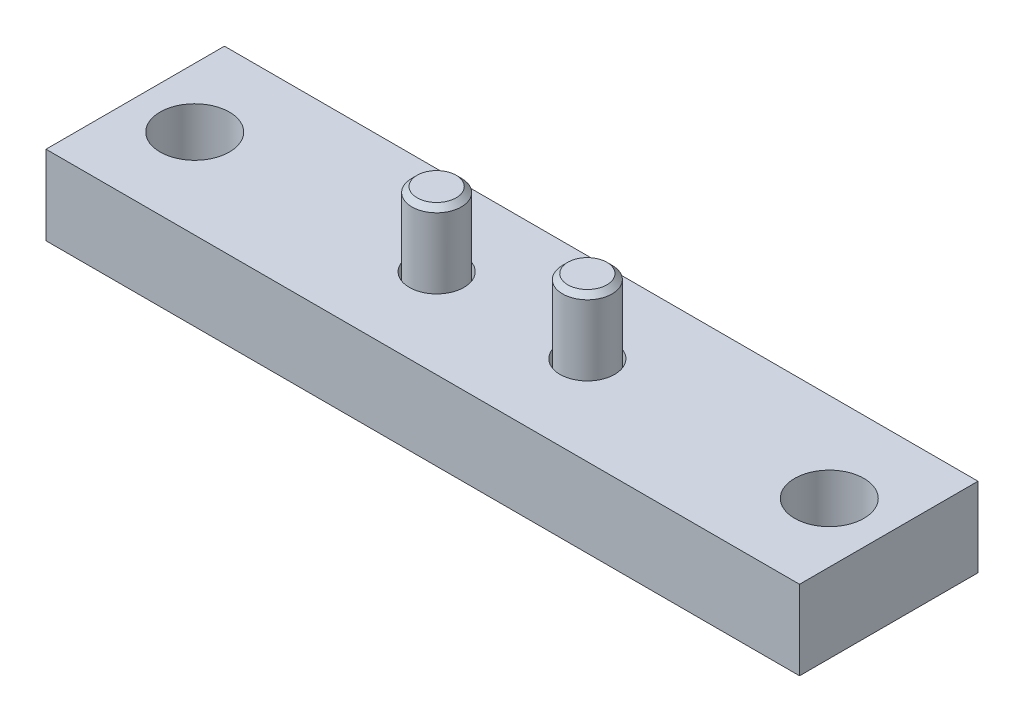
ISO-10303-21;
HEADER;
FILE_DESCRIPTION(('STEP AP214'),'2;1');
FILE_NAME('part.step','',(''),(''),'','','');
FILE_SCHEMA(('AUTOMOTIVE_DESIGN { 1 0 10303 214 1 1 1 1 }'));
ENDSEC;
DATA;
#1=APPLICATION_CONTEXT('core data for automotive mechanical design processes');
#2=APPLICATION_PROTOCOL_DEFINITION('international standard','automotive_design',2000,#1);
#3=PRODUCT_CONTEXT('',#1,'mechanical');
#4=PRODUCT('Part','Part','',(#3));
#5=PRODUCT_RELATED_PRODUCT_CATEGORY('part','',(#4));
#6=PRODUCT_DEFINITION_FORMATION('','',#4);
#7=PRODUCT_DEFINITION_CONTEXT('part definition',#1,'design');
#8=PRODUCT_DEFINITION('design','',#6,#7);
#9=PRODUCT_DEFINITION_SHAPE('','',#8);
#10=(LENGTH_UNIT() NAMED_UNIT(*) SI_UNIT(.MILLI.,.METRE.));
#11=(NAMED_UNIT(*) PLANE_ANGLE_UNIT() SI_UNIT($,.RADIAN.));
#12=(NAMED_UNIT(*) SI_UNIT($,.STERADIAN.) SOLID_ANGLE_UNIT());
#13=UNCERTAINTY_MEASURE_WITH_UNIT(LENGTH_MEASURE(1.E-05),#10,'distance_accuracy_value','');
#14=(GEOMETRIC_REPRESENTATION_CONTEXT(3) GLOBAL_UNCERTAINTY_ASSIGNED_CONTEXT((#13)) GLOBAL_UNIT_ASSIGNED_CONTEXT((#10,
#11,#12)) REPRESENTATION_CONTEXT('',''));
#15=CARTESIAN_POINT('',(0.,0.,0.));
#16=DIRECTION('',(0.,0.,1.));
#17=DIRECTION('',(1.,0.,0.));
#18=AXIS2_PLACEMENT_3D('',#15,#16,#17);
#19=CARTESIAN_POINT('',(60.325,-12.7,-14.2875));
#20=DIRECTION('',(0.,-1.,0.));
#21=DIRECTION('',(0.,0.,1.));
#22=AXIS2_PLACEMENT_3D('',#19,#20,#21);
#23=PLANE('',#22);
#24=CARTESIAN_POINT('',(50.8,-12.7,0.));
#25=DIRECTION('',(0.,-1.,0.));
#26=DIRECTION('',(0.,0.,1.));
#27=AXIS2_PLACEMENT_3D('',#24,#25,#26);
#28=CIRCLE('',#27,5.5499);
#29=CARTESIAN_POINT('',(50.8,-12.7,5.5499));
#30=VERTEX_POINT('',#29);
#31=EDGE_CURVE('E257',#30,#30,#28,.T.);
#32=ORIENTED_EDGE('',*,*,#31,.F.);
#33=EDGE_LOOP('',(#32));
#34=FACE_BOUND('',#33,.T.);
#35=CARTESIAN_POINT('',(-50.8,-12.7,0.));
#36=DIRECTION('',(0.,-1.,0.));
#37=DIRECTION('',(0.,0.,1.));
#38=AXIS2_PLACEMENT_3D('',#35,#36,#37);
#39=CIRCLE('',#38,5.5499);
#40=CARTESIAN_POINT('',(-50.8,-12.7,5.5499));
#41=VERTEX_POINT('',#40);
#42=EDGE_CURVE('E390',#41,#41,#39,.T.);
#43=ORIENTED_EDGE('',*,*,#42,.F.);
#44=EDGE_LOOP('',(#43));
#45=FACE_BOUND('',#44,.T.);
#46=CARTESIAN_POINT('',(12.065,-12.7,0.));
#47=DIRECTION('',(0.,-1.,0.));
#48=DIRECTION('',(0.,0.,1.));
#49=AXIS2_PLACEMENT_3D('',#46,#47,#48);
#50=CIRCLE('',#49,7.112);
#51=CARTESIAN_POINT('',(12.065,-12.7,7.112));
#52=VERTEX_POINT('',#51);
#53=EDGE_CURVE('E378',#52,#52,#50,.T.);
#54=ORIENTED_EDGE('',*,*,#53,.F.);
#55=EDGE_LOOP('',(#54));
#56=FACE_BOUND('',#55,.T.);
#57=CARTESIAN_POINT('',(-12.065,-12.7,0.));
#58=DIRECTION('',(0.,-1.,0.));
#59=DIRECTION('',(0.,0.,1.));
#60=AXIS2_PLACEMENT_3D('',#57,#58,#59);
#61=CIRCLE('',#60,7.112);
#62=CARTESIAN_POINT('',(-12.065,-12.7,7.112));
#63=VERTEX_POINT('',#62);
#64=EDGE_CURVE('E362',#63,#63,#61,.T.);
#65=ORIENTED_EDGE('',*,*,#64,.F.);
#66=EDGE_LOOP('',(#65));
#67=FACE_BOUND('',#66,.T.);
#68=DIRECTION('',(0.,0.,1.));
#69=VECTOR('',#68,1.);
#70=CARTESIAN_POINT('',(60.325,-12.7,-14.2875));
#71=LINE('',#70,#69);
#72=CARTESIAN_POINT('',(60.325,-12.7,-14.2875));
#73=VERTEX_POINT('',#72);
#74=CARTESIAN_POINT('',(60.325,-12.7,14.2875));
#75=VERTEX_POINT('',#74);
#76=EDGE_CURVE('E354',#73,#75,#71,.T.);
#77=ORIENTED_EDGE('',*,*,#76,.T.);
#78=DIRECTION('',(-1.,0.,0.));
#79=VECTOR('',#78,1.);
#80=CARTESIAN_POINT('',(60.325,-12.7,14.2875));
#81=LINE('',#80,#79);
#82=CARTESIAN_POINT('',(-60.325,-12.7,14.2875));
#83=VERTEX_POINT('',#82);
#84=EDGE_CURVE('E366',#75,#83,#81,.T.);
#85=ORIENTED_EDGE('',*,*,#84,.T.);
#86=DIRECTION('',(0.,0.,-1.));
#87=VECTOR('',#86,1.);
#88=CARTESIAN_POINT('',(-60.325,-12.7,-14.2875));
#89=LINE('',#88,#87);
#90=CARTESIAN_POINT('',(-60.325,-12.7,-14.2875));
#91=VERTEX_POINT('',#90);
#92=EDGE_CURVE('E364',#83,#91,#89,.T.);
#93=ORIENTED_EDGE('',*,*,#92,.T.);
#94=DIRECTION('',(1.,0.,0.));
#95=VECTOR('',#94,1.);
#96=CARTESIAN_POINT('',(60.325,-12.7,-14.2875));
#97=LINE('',#96,#95);
#98=EDGE_CURVE('E35',#91,#73,#97,.T.);
#99=ORIENTED_EDGE('',*,*,#98,.T.);
#100=EDGE_LOOP('',(#77,#85,#93,#99));
#101=FACE_BOUND('',#100,.T.);
#102=ADVANCED_FACE('F16',(#34,#45,#56,#67,#101),#23,.T.);
#103=CARTESIAN_POINT('',(12.065,-12.7,0.));
#104=DIRECTION('',(0.,-1.,0.));
#105=DIRECTION('',(0.,0.,1.));
#106=AXIS2_PLACEMENT_3D('',#103,#104,#105);
#107=CYLINDRICAL_SURFACE('',#106,7.112);
#108=CARTESIAN_POINT('',(12.065,-4.064,0.));
#109=DIRECTION('',(0.,-1.,0.));
#110=DIRECTION('',(0.,0.,1.));
#111=AXIS2_PLACEMENT_3D('',#108,#109,#110);
#112=CIRCLE('',#111,7.112);
#113=CARTESIAN_POINT('',(12.065,-4.064,7.112));
#114=VERTEX_POINT('',#113);
#115=EDGE_CURVE('E381',#114,#114,#112,.T.);
#116=ORIENTED_EDGE('',*,*,#115,.F.);
#117=EDGE_LOOP('',(#116));
#118=FACE_BOUND('',#117,.T.);
#119=ORIENTED_EDGE('',*,*,#53,.T.);
#120=EDGE_LOOP('',(#119));
#121=FACE_BOUND('',#120,.T.);
#122=ADVANCED_FACE('F403',(#118,#121),#107,.F.);
#123=CARTESIAN_POINT('',(7.6962,-4.064,0.));
#124=DIRECTION('',(0.,1.,0.));
#125=DIRECTION('',(0.,0.,-1.));
#126=AXIS2_PLACEMENT_3D('',#123,#124,#125);
#127=PLANE('',#126);
#128=CARTESIAN_POINT('',(12.065,-4.064,0.));
#129=DIRECTION('',(0.,1.,0.));
#130=DIRECTION('',(0.,0.,1.));
#131=AXIS2_PLACEMENT_3D('',#128,#129,#130);
#132=CIRCLE('',#131,5.95376);
#133=CARTESIAN_POINT('',(12.065,-4.064,5.95376));
#134=VERTEX_POINT('',#133);
#135=EDGE_CURVE('E334',#134,#134,#132,.T.);
#136=ORIENTED_EDGE('',*,*,#135,.T.);
#137=EDGE_LOOP('',(#136));
#138=FACE_BOUND('',#137,.T.);
#139=ORIENTED_EDGE('',*,*,#115,.T.);
#140=EDGE_LOOP('',(#139));
#141=FACE_BOUND('',#140,.T.);
#142=ADVANCED_FACE('F524',(#138,#141),#127,.F.);
#143=CARTESIAN_POINT('',(-12.065,-12.7,0.));
#144=DIRECTION('',(0.,-1.,0.));
#145=DIRECTION('',(0.,0.,1.));
#146=AXIS2_PLACEMENT_3D('',#143,#144,#145);
#147=CYLINDRICAL_SURFACE('',#146,7.112);
#148=CARTESIAN_POINT('',(-12.065,-4.064,0.));
#149=DIRECTION('',(0.,-1.,0.));
#150=DIRECTION('',(0.,0.,1.));
#151=AXIS2_PLACEMENT_3D('',#148,#149,#150);
#152=CIRCLE('',#151,7.112);
#153=CARTESIAN_POINT('',(-12.065,-4.064,7.112));
#154=VERTEX_POINT('',#153);
#155=EDGE_CURVE('E372',#154,#154,#152,.T.);
#156=ORIENTED_EDGE('',*,*,#155,.F.);
#157=EDGE_LOOP('',(#156));
#158=FACE_BOUND('',#157,.T.);
#159=ORIENTED_EDGE('',*,*,#64,.T.);
#160=EDGE_LOOP('',(#159));
#161=FACE_BOUND('',#160,.T.);
#162=ADVANCED_FACE('F521',(#158,#161),#147,.F.);
#163=CARTESIAN_POINT('',(-16.4338,-4.064,0.));
#164=DIRECTION('',(0.,1.,0.));
#165=DIRECTION('',(0.,0.,-1.));
#166=AXIS2_PLACEMENT_3D('',#163,#164,#165);
#167=PLANE('',#166);
#168=CARTESIAN_POINT('',(-12.065,-4.064,0.));
#169=DIRECTION('',(0.,1.,0.));
#170=DIRECTION('',(0.,0.,1.));
#171=AXIS2_PLACEMENT_3D('',#168,#169,#170);
#172=CIRCLE('',#171,5.95376);
#173=CARTESIAN_POINT('',(-12.065,-4.064,5.95376));
#174=VERTEX_POINT('',#173);
#175=EDGE_CURVE('E10',#174,#174,#172,.T.);
#176=ORIENTED_EDGE('',*,*,#175,.T.);
#177=EDGE_LOOP('',(#176));
#178=FACE_BOUND('',#177,.T.);
#179=ORIENTED_EDGE('',*,*,#155,.T.);
#180=EDGE_LOOP('',(#179));
#181=FACE_BOUND('',#180,.T.);
#182=ADVANCED_FACE('F518',(#178,#181),#167,.F.);
#183=CARTESIAN_POINT('',(60.325,-12.7,14.2875));
#184=DIRECTION('',(0.,0.,-1.));
#185=DIRECTION('',(1.,0.,0.));
#186=AXIS2_PLACEMENT_3D('',#183,#184,#185);
#187=PLANE('',#186);
#188=DIRECTION('',(-1.,0.,0.));
#189=VECTOR('',#188,1.);
#190=CARTESIAN_POINT('',(60.325,0.,14.2875));
#191=LINE('',#190,#189);
#192=CARTESIAN_POINT('',(60.325,0.,14.2875));
#193=VERTEX_POINT('',#192);
#194=CARTESIAN_POINT('',(-60.325,0.,14.2875));
#195=VERTEX_POINT('',#194);
#196=EDGE_CURVE('E357',#193,#195,#191,.T.);
#197=ORIENTED_EDGE('',*,*,#196,.T.);
#198=DIRECTION('',(0.,1.,0.));
#199=VECTOR('',#198,1.);
#200=CARTESIAN_POINT('',(-60.325,-12.7,14.2875));
#201=LINE('',#200,#199);
#202=EDGE_CURVE('E343',#83,#195,#201,.T.);
#203=ORIENTED_EDGE('',*,*,#202,.F.);
#204=ORIENTED_EDGE('',*,*,#84,.F.);
#205=DIRECTION('',(0.,1.,0.));
#206=VECTOR('',#205,1.);
#207=CARTESIAN_POINT('',(60.325,-12.7,14.2875));
#208=LINE('',#207,#206);
#209=EDGE_CURVE('E340',#75,#193,#208,.T.);
#210=ORIENTED_EDGE('',*,*,#209,.T.);
#211=EDGE_LOOP('',(#197,#203,#204,#210));
#212=FACE_BOUND('',#211,.T.);
#213=ADVANCED_FACE('F420',(#212),#187,.F.);
#214=CARTESIAN_POINT('',(-60.325,-12.7,-14.2875));
#215=DIRECTION('',(1.,0.,0.));
#216=DIRECTION('',(0.,0.,1.));
#217=AXIS2_PLACEMENT_3D('',#214,#215,#216);
#218=PLANE('',#217);
#219=DIRECTION('',(0.,0.,-1.));
#220=VECTOR('',#219,1.);
#221=CARTESIAN_POINT('',(-60.325,0.,-14.2875));
#222=LINE('',#221,#220);
#223=CARTESIAN_POINT('',(-60.325,0.,-14.2875));
#224=VERTEX_POINT('',#223);
#225=EDGE_CURVE('E355',#195,#224,#222,.T.);
#226=ORIENTED_EDGE('',*,*,#225,.T.);
#227=DIRECTION('',(0.,1.,0.));
#228=VECTOR('',#227,1.);
#229=CARTESIAN_POINT('',(-60.325,-12.7,-14.2875));
#230=LINE('',#229,#228);
#231=EDGE_CURVE('E346',#91,#224,#230,.T.);
#232=ORIENTED_EDGE('',*,*,#231,.F.);
#233=ORIENTED_EDGE('',*,*,#92,.F.);
#234=ORIENTED_EDGE('',*,*,#202,.T.);
#235=EDGE_LOOP('',(#226,#232,#233,#234));
#236=FACE_BOUND('',#235,.T.);
#237=ADVANCED_FACE('F425',(#236),#218,.F.);
#238=CARTESIAN_POINT('',(60.325,-12.7,-14.2875));
#239=DIRECTION('',(0.,0.,1.));
#240=DIRECTION('',(-1.,0.,0.));
#241=AXIS2_PLACEMENT_3D('',#238,#239,#240);
#242=PLANE('',#241);
#243=DIRECTION('',(1.,0.,0.));
#244=VECTOR('',#243,1.);
#245=CARTESIAN_POINT('',(60.325,0.,-14.2875));
#246=LINE('',#245,#244);
#247=CARTESIAN_POINT('',(60.325,0.,-14.2875));
#248=VERTEX_POINT('',#247);
#249=EDGE_CURVE('E352',#224,#248,#246,.T.);
#250=ORIENTED_EDGE('',*,*,#249,.T.);
#251=DIRECTION('',(0.,1.,0.));
#252=VECTOR('',#251,1.);
#253=CARTESIAN_POINT('',(60.325,-12.7,-14.2875));
#254=LINE('',#253,#252);
#255=EDGE_CURVE('E349',#73,#248,#254,.T.);
#256=ORIENTED_EDGE('',*,*,#255,.F.);
#257=ORIENTED_EDGE('',*,*,#98,.F.);
#258=ORIENTED_EDGE('',*,*,#231,.T.);
#259=EDGE_LOOP('',(#250,#256,#257,#258));
#260=FACE_BOUND('',#259,.T.);
#261=ADVANCED_FACE('F428',(#260),#242,.F.);
#262=CARTESIAN_POINT('',(60.325,-12.7,-14.2875));
#263=DIRECTION('',(-1.,0.,0.));
#264=DIRECTION('',(0.,0.,-1.));
#265=AXIS2_PLACEMENT_3D('',#262,#263,#264);
#266=PLANE('',#265);
#267=DIRECTION('',(0.,0.,1.));
#268=VECTOR('',#267,1.);
#269=CARTESIAN_POINT('',(60.325,0.,-14.2875));
#270=LINE('',#269,#268);
#271=EDGE_CURVE('E359',#248,#193,#270,.T.);
#272=ORIENTED_EDGE('',*,*,#271,.T.);
#273=ORIENTED_EDGE('',*,*,#209,.F.);
#274=ORIENTED_EDGE('',*,*,#76,.F.);
#275=ORIENTED_EDGE('',*,*,#255,.T.);
#276=EDGE_LOOP('',(#272,#273,#274,#275));
#277=FACE_BOUND('',#276,.T.);
#278=ADVANCED_FACE('F417',(#277),#266,.F.);
#279=CARTESIAN_POINT('',(-50.8,-12.7,0.));
#280=DIRECTION('',(0.,-1.,0.));
#281=DIRECTION('',(0.,0.,1.));
#282=AXIS2_PLACEMENT_3D('',#279,#280,#281);
#283=CYLINDRICAL_SURFACE('',#282,5.5499);
#284=CARTESIAN_POINT('',(-50.8,0.,0.));
#285=DIRECTION('',(0.,-1.,0.));
#286=DIRECTION('',(0.,0.,1.));
#287=AXIS2_PLACEMENT_3D('',#284,#285,#286);
#288=CIRCLE('',#287,5.5499);
#289=CARTESIAN_POINT('',(-50.8,0.,5.5499));
#290=VERTEX_POINT('',#289);
#291=EDGE_CURVE('E387',#290,#290,#288,.T.);
#292=ORIENTED_EDGE('',*,*,#291,.F.);
#293=EDGE_LOOP('',(#292));
#294=FACE_BOUND('',#293,.T.);
#295=ORIENTED_EDGE('',*,*,#42,.T.);
#296=EDGE_LOOP('',(#295));
#297=FACE_BOUND('',#296,.T.);
#298=ADVANCED_FACE('F444',(#294,#297),#283,.F.);
#299=CARTESIAN_POINT('',(50.8,-12.7,0.));
#300=DIRECTION('',(0.,-1.,0.));
#301=DIRECTION('',(0.,0.,1.));
#302=AXIS2_PLACEMENT_3D('',#299,#300,#301);
#303=CYLINDRICAL_SURFACE('',#302,5.5499);
#304=CARTESIAN_POINT('',(50.8,0.,0.));
#305=DIRECTION('',(0.,-1.,0.));
#306=DIRECTION('',(0.,0.,1.));
#307=AXIS2_PLACEMENT_3D('',#304,#305,#306);
#308=CIRCLE('',#307,5.5499);
#309=CARTESIAN_POINT('',(50.8,0.,5.5499));
#310=VERTEX_POINT('',#309);
#311=EDGE_CURVE('E393',#310,#310,#308,.T.);
#312=ORIENTED_EDGE('',*,*,#311,.F.);
#313=EDGE_LOOP('',(#312));
#314=FACE_BOUND('',#313,.T.);
#315=ORIENTED_EDGE('',*,*,#31,.T.);
#316=EDGE_LOOP('',(#315));
#317=FACE_BOUND('',#316,.T.);
#318=ADVANCED_FACE('F399',(#314,#317),#303,.F.);
#319=CARTESIAN_POINT('',(60.325,0.,-14.2875));
#320=DIRECTION('',(0.,-1.,0.));
#321=DIRECTION('',(0.,0.,1.));
#322=AXIS2_PLACEMENT_3D('',#319,#320,#321);
#323=PLANE('',#322);
#324=ORIENTED_EDGE('',*,*,#311,.T.);
#325=EDGE_LOOP('',(#324));
#326=FACE_BOUND('',#325,.T.);
#327=ORIENTED_EDGE('',*,*,#291,.T.);
#328=EDGE_LOOP('',(#327));
#329=FACE_BOUND('',#328,.T.);
#330=CARTESIAN_POINT('',(12.065,0.,0.));
#331=DIRECTION('',(0.,-1.,0.));
#332=DIRECTION('',(0.,0.,1.));
#333=AXIS2_PLACEMENT_3D('',#330,#331,#332);
#334=CIRCLE('',#333,4.3688);
#335=CARTESIAN_POINT('',(12.065,0.,4.3688));
#336=VERTEX_POINT('',#335);
#337=EDGE_CURVE('E384',#336,#336,#334,.T.);
#338=ORIENTED_EDGE('',*,*,#337,.T.);
#339=EDGE_LOOP('',(#338));
#340=FACE_BOUND('',#339,.T.);
#341=CARTESIAN_POINT('',(-12.065,0.,0.));
#342=DIRECTION('',(0.,-1.,0.));
#343=DIRECTION('',(0.,0.,1.));
#344=AXIS2_PLACEMENT_3D('',#341,#342,#343);
#345=CIRCLE('',#344,4.3688);
#346=CARTESIAN_POINT('',(-12.065,0.,4.3688));
#347=VERTEX_POINT('',#346);
#348=EDGE_CURVE('E375',#347,#347,#345,.T.);
#349=ORIENTED_EDGE('',*,*,#348,.T.);
#350=EDGE_LOOP('',(#349));
#351=FACE_BOUND('',#350,.T.);
#352=ORIENTED_EDGE('',*,*,#271,.F.);
#353=ORIENTED_EDGE('',*,*,#249,.F.);
#354=ORIENTED_EDGE('',*,*,#225,.F.);
#355=ORIENTED_EDGE('',*,*,#196,.F.);
#356=EDGE_LOOP('',(#352,#353,#354,#355));
#357=FACE_BOUND('',#356,.T.);
#358=ADVANCED_FACE('F430',(#326,#329,#340,#351,#357),#323,.F.);
#359=CARTESIAN_POINT('',(12.065,-12.7,0.));
#360=DIRECTION('',(0.,-1.,0.));
#361=DIRECTION('',(0.,0.,1.));
#362=AXIS2_PLACEMENT_3D('',#359,#360,#361);
#363=CYLINDRICAL_SURFACE('',#362,4.3688);
#364=ORIENTED_EDGE('',*,*,#337,.F.);
#365=EDGE_LOOP('',(#364));
#366=FACE_BOUND('',#365,.T.);
#367=CARTESIAN_POINT('',(12.065,-4.06283113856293,0.));
#368=DIRECTION('',(0.,1.,0.));
#369=DIRECTION('',(0.,0.,1.));
#370=AXIS2_PLACEMENT_3D('',#367,#368,#369);
#371=CIRCLE('',#370,4.3688);
#372=CARTESIAN_POINT('',(12.065,-4.06283113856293,4.3688));
#373=VERTEX_POINT('',#372);
#374=EDGE_CURVE('E337',#373,#373,#371,.T.);
#375=ORIENTED_EDGE('',*,*,#374,.F.);
#376=EDGE_LOOP('',(#375));
#377=FACE_BOUND('',#376,.T.);
#378=ADVANCED_FACE('F432',(#366,#377),#363,.F.);
#379=CARTESIAN_POINT('',(-12.065,-12.7,0.));
#380=DIRECTION('',(0.,-1.,0.));
#381=DIRECTION('',(0.,0.,1.));
#382=AXIS2_PLACEMENT_3D('',#379,#380,#381);
#383=CYLINDRICAL_SURFACE('',#382,4.3688);
#384=ORIENTED_EDGE('',*,*,#348,.F.);
#385=EDGE_LOOP('',(#384));
#386=FACE_BOUND('',#385,.T.);
#387=CARTESIAN_POINT('',(-12.065,-4.06283113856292,0.));
#388=DIRECTION('',(0.,1.,0.));
#389=DIRECTION('',(0.,0.,1.));
#390=AXIS2_PLACEMENT_3D('',#387,#388,#389);
#391=CIRCLE('',#390,4.3688);
#392=CARTESIAN_POINT('',(-12.065,-4.06283113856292,4.3688));
#393=VERTEX_POINT('',#392);
#394=EDGE_CURVE('E26',#393,#393,#391,.T.);
#395=ORIENTED_EDGE('',*,*,#394,.F.);
#396=EDGE_LOOP('',(#395));
#397=FACE_BOUND('',#396,.T.);
#398=ADVANCED_FACE('F441',(#386,#397),#383,.F.);
#399=CARTESIAN_POINT('',(-15.19428,11.811,0.));
#400=DIRECTION('',(0.,1.,0.));
#401=DIRECTION('',(0.,0.,-1.));
#402=AXIS2_PLACEMENT_3D('',#399,#400,#401);
#403=PLANE('',#402);
#404=CARTESIAN_POINT('',(-12.065,11.811,0.));
#405=DIRECTION('',(0.,-1.,0.));
#406=DIRECTION('',(0.,0.,1.));
#407=AXIS2_PLACEMENT_3D('',#404,#405,#406);
#408=CIRCLE('',#407,3.12928);
#409=CARTESIAN_POINT('',(-12.065,11.811,3.12928));
#410=VERTEX_POINT('',#409);
#411=EDGE_CURVE('E258',#410,#410,#408,.T.);
#412=ORIENTED_EDGE('',*,*,#411,.F.);
#413=EDGE_LOOP('',(#412));
#414=FACE_BOUND('',#413,.T.);
#415=ADVANCED_FACE('F503',(#414),#403,.T.);
#416=CARTESIAN_POINT('',(-12.065,11.811,0.));
#417=DIRECTION('',(0.,-1.,0.));
#418=DIRECTION('',(0.,0.,1.));
#419=AXIS2_PLACEMENT_3D('',#416,#417,#418);
#420=CONICAL_SURFACE('',#419,3.12928,0.785398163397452);
#421=CARTESIAN_POINT('',(-12.065,10.97153,0.));
#422=DIRECTION('',(0.,-1.,0.));
#423=DIRECTION('',(0.,0.,1.));
#424=AXIS2_PLACEMENT_3D('',#421,#422,#423);
#425=CIRCLE('',#424,3.96875);
#426=CARTESIAN_POINT('',(-12.065,10.97153,3.96875));
#427=VERTEX_POINT('',#426);
#428=EDGE_CURVE('E261',#427,#427,#425,.T.);
#429=ORIENTED_EDGE('',*,*,#428,.F.);
#430=EDGE_LOOP('',(#429));
#431=FACE_BOUND('',#430,.T.);
#432=ORIENTED_EDGE('',*,*,#411,.T.);
#433=EDGE_LOOP('',(#432));
#434=FACE_BOUND('',#433,.T.);
#435=ADVANCED_FACE('F510',(#431,#434),#420,.T.);
#436=CARTESIAN_POINT('',(-12.065,-43.7515,0.));
#437=DIRECTION('',(0.,-1.,0.));
#438=DIRECTION('',(0.,0.,1.));
#439=AXIS2_PLACEMENT_3D('',#436,#437,#438);
#440=CYLINDRICAL_SURFACE('',#439,3.96875);
#441=CARTESIAN_POINT('',(-12.065,-3.6322,0.));
#442=DIRECTION('',(0.,1.,0.));
#443=DIRECTION('',(0.,0.,-1.));
#444=AXIS2_PLACEMENT_3D('',#441,#442,#443);
#445=CIRCLE('',#444,3.96875);
#446=CARTESIAN_POINT('',(-12.065,-3.6322,-3.96875));
#447=VERTEX_POINT('',#446);
#448=EDGE_CURVE('E254',#447,#447,#445,.T.);
#449=ORIENTED_EDGE('',*,*,#448,.T.);
#450=EDGE_LOOP('',(#449));
#451=FACE_BOUND('',#450,.T.);
#452=ORIENTED_EDGE('',*,*,#428,.T.);
#453=EDGE_LOOP('',(#452));
#454=FACE_BOUND('',#453,.T.);
#455=ADVANCED_FACE('F594',(#451,#454),#440,.T.);
#456=CARTESIAN_POINT('',(-12.065,-3.6322,0.));
#457=DIRECTION('',(0.,1.,0.));
#458=DIRECTION('',(0.,0.,-1.));
#459=AXIS2_PLACEMENT_3D('',#456,#457,#458);
#460=TOROIDAL_SURFACE('',#459,4.40055,0.4318);
#461=ORIENTED_EDGE('',*,*,#448,.F.);
#462=EDGE_LOOP('',(#461));
#463=FACE_BOUND('',#462,.T.);
#464=ORIENTED_EDGE('',*,*,#394,.T.);
#465=EDGE_LOOP('',(#464));
#466=FACE_BOUND('',#465,.T.);
#467=ADVANCED_FACE('F597',(#463,#466),#460,.F.);
#468=CARTESIAN_POINT('',(-12.065,-8.1661,0.));
#469=DIRECTION('',(0.,-1.,0.));
#470=DIRECTION('',(0.,0.,1.));
#471=AXIS2_PLACEMENT_3D('',#468,#469,#470);
#472=CONICAL_SURFACE('',#471,3.175,1.0471975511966);
#473=CARTESIAN_POINT('',(-12.065,-6.33301289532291,0.));
#474=VERTEX_POINT('',#473);
#475=VERTEX_LOOP('',#474);
#476=FACE_BOUND('',#475,.T.);
#477=CARTESIAN_POINT('',(-12.065,-8.1661,0.));
#478=DIRECTION('',(0.,-1.,0.));
#479=DIRECTION('',(0.,0.,1.));
#480=AXIS2_PLACEMENT_3D('',#477,#478,#479);
#481=CIRCLE('',#480,3.175);
#482=CARTESIAN_POINT('',(-12.065,-8.1661,3.175));
#483=VERTEX_POINT('',#482);
#484=CARTESIAN_POINT('',(-14.8146306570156,-8.1661,1.5875));
#485=VERTEX_POINT('',#484);
#486=EDGE_CURVE('E270',#483,#485,#481,.T.);
#487=ORIENTED_EDGE('',*,*,#486,.T.);
#488=CARTESIAN_POINT('',(-14.8146306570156,-8.1661,-1.5875));
#489=VERTEX_POINT('',#488);
#490=EDGE_CURVE('E273',#485,#489,#481,.T.);
#491=ORIENTED_EDGE('',*,*,#490,.T.);
#492=CARTESIAN_POINT('',(-12.065,-8.1661,-3.175));
#493=VERTEX_POINT('',#492);
#494=EDGE_CURVE('E1112',#489,#493,#481,.T.);
#495=ORIENTED_EDGE('',*,*,#494,.T.);
#496=CARTESIAN_POINT('',(-9.31536934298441,-8.1661,-1.5875));
#497=VERTEX_POINT('',#496);
#498=EDGE_CURVE('E1125',#493,#497,#481,.T.);
#499=ORIENTED_EDGE('',*,*,#498,.T.);
#500=CARTESIAN_POINT('',(-9.31536934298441,-8.1661,1.5875));
#501=VERTEX_POINT('',#500);
#502=EDGE_CURVE('E1124',#497,#501,#481,.T.);
#503=ORIENTED_EDGE('',*,*,#502,.T.);
#504=EDGE_CURVE('E274',#501,#483,#481,.T.);
#505=ORIENTED_EDGE('',*,*,#504,.T.);
#506=EDGE_LOOP('',(#487,#491,#495,#499,#503,#505));
#507=FACE_BOUND('',#506,.T.);
#508=ADVANCED_FACE('F609',(#476,#507),#472,.F.);
#509=CARTESIAN_POINT('',(-13.8980871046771,-8.1661,3.175));
#510=DIRECTION('',(0.,-1.,0.));
#511=DIRECTION('',(0.,0.,1.));
#512=AXIS2_PLACEMENT_3D('',#509,#510,#511);
#513=PLANE('',#512);
#514=ORIENTED_EDGE('',*,*,#494,.F.);
#515=DIRECTION('',(0.5,0.,-0.866025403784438));
#516=VECTOR('',#515,1.);
#517=CARTESIAN_POINT('',(-15.7311742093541,-8.1661,0.));
#518=LINE('',#517,#516);
#519=CARTESIAN_POINT('',(-13.8980871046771,-8.1661,-3.175));
#520=VERTEX_POINT('',#519);
#521=EDGE_CURVE('E296',#489,#520,#518,.T.);
#522=ORIENTED_EDGE('',*,*,#521,.T.);
#523=DIRECTION('',(1.,0.,0.));
#524=VECTOR('',#523,1.);
#525=CARTESIAN_POINT('',(-13.8980871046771,-8.1661,-3.175));
#526=LINE('',#525,#524);
#527=EDGE_CURVE('E297',#520,#493,#526,.T.);
#528=ORIENTED_EDGE('',*,*,#527,.T.);
#529=EDGE_LOOP('',(#514,#522,#528));
#530=FACE_BOUND('',#529,.T.);
#531=ADVANCED_FACE('F613',(#530),#513,.T.);
#532=ORIENTED_EDGE('',*,*,#498,.F.);
#533=CARTESIAN_POINT('',(-10.2319128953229,-8.1661,-3.175));
#534=VERTEX_POINT('',#533);
#535=EDGE_CURVE('E300',#493,#534,#526,.T.);
#536=ORIENTED_EDGE('',*,*,#535,.T.);
#537=DIRECTION('',(-0.5,0.,-0.86602540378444));
#538=VECTOR('',#537,1.);
#539=CARTESIAN_POINT('',(-8.39882579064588,-8.1661,0.));
#540=LINE('',#539,#538);
#541=EDGE_CURVE('E304',#497,#534,#540,.T.);
#542=ORIENTED_EDGE('',*,*,#541,.F.);
#543=EDGE_LOOP('',(#532,#536,#542));
#544=FACE_BOUND('',#543,.T.);
#545=ADVANCED_FACE('F902',(#544),#513,.T.);
#546=ORIENTED_EDGE('',*,*,#502,.F.);
#547=CARTESIAN_POINT('',(-8.39882579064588,-8.1661,0.));
#548=VERTEX_POINT('',#547);
#549=EDGE_CURVE('E301',#548,#497,#540,.T.);
#550=ORIENTED_EDGE('',*,*,#549,.F.);
#551=DIRECTION('',(0.5,0.,-0.866025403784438));
#552=VECTOR('',#551,1.);
#553=CARTESIAN_POINT('',(-10.2319128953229,-8.1661,3.175));
#554=LINE('',#553,#552);
#555=EDGE_CURVE('E308',#501,#548,#554,.T.);
#556=ORIENTED_EDGE('',*,*,#555,.F.);
#557=EDGE_LOOP('',(#546,#550,#556));
#558=FACE_BOUND('',#557,.T.);
#559=ADVANCED_FACE('F642',(#558),#513,.T.);
#560=ORIENTED_EDGE('',*,*,#504,.F.);
#561=CARTESIAN_POINT('',(-10.2319128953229,-8.1661,3.175));
#562=VERTEX_POINT('',#561);
#563=EDGE_CURVE('E305',#562,#501,#554,.T.);
#564=ORIENTED_EDGE('',*,*,#563,.F.);
#565=DIRECTION('',(-1.,0.,0.));
#566=VECTOR('',#565,1.);
#567=CARTESIAN_POINT('',(-10.2319128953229,-8.1661,3.175));
#568=LINE('',#567,#566);
#569=EDGE_CURVE('E309',#562,#483,#568,.T.);
#570=ORIENTED_EDGE('',*,*,#569,.T.);
#571=EDGE_LOOP('',(#560,#564,#570));
#572=FACE_BOUND('',#571,.T.);
#573=ADVANCED_FACE('F640',(#572),#513,.T.);
#574=ORIENTED_EDGE('',*,*,#486,.F.);
#575=CARTESIAN_POINT('',(-13.8980871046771,-8.1661,3.175));
#576=VERTEX_POINT('',#575);
#577=EDGE_CURVE('E312',#483,#576,#568,.T.);
#578=ORIENTED_EDGE('',*,*,#577,.T.);
#579=DIRECTION('',(0.5,0.,0.86602540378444));
#580=VECTOR('',#579,1.);
#581=CARTESIAN_POINT('',(-15.7311742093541,-8.1661,0.));
#582=LINE('',#581,#580);
#583=EDGE_CURVE('E315',#485,#576,#582,.T.);
#584=ORIENTED_EDGE('',*,*,#583,.F.);
#585=EDGE_LOOP('',(#574,#578,#584));
#586=FACE_BOUND('',#585,.T.);
#587=ADVANCED_FACE('F615',(#586),#513,.T.);
#588=ORIENTED_EDGE('',*,*,#490,.F.);
#589=CARTESIAN_POINT('',(-15.7311742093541,-8.1661,0.));
#590=VERTEX_POINT('',#589);
#591=EDGE_CURVE('E313',#590,#485,#582,.T.);
#592=ORIENTED_EDGE('',*,*,#591,.F.);
#593=EDGE_CURVE('E293',#590,#489,#518,.T.);
#594=ORIENTED_EDGE('',*,*,#593,.T.);
#595=EDGE_LOOP('',(#588,#592,#594));
#596=FACE_BOUND('',#595,.T.);
#597=ADVANCED_FACE('F638',(#596),#513,.T.);
#598=CARTESIAN_POINT('',(-15.7311742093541,-8.1661,0.));
#599=DIRECTION('',(-0.866025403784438,0.,-0.5));
#600=DIRECTION('',(-0.5,0.,0.866025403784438));
#601=AXIS2_PLACEMENT_3D('',#598,#599,#600);
#602=PLANE('',#601);
#603=DIRECTION('',(0.5,0.,-0.866025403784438));
#604=VECTOR('',#603,1.);
#605=CARTESIAN_POINT('',(-15.7311742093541,-12.0015,0.));
#606=LINE('',#605,#604);
#607=CARTESIAN_POINT('',(-15.7311742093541,-12.0015,0.));
#608=VERTEX_POINT('',#607);
#609=CARTESIAN_POINT('',(-13.8980871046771,-12.0015,-3.175));
#610=VERTEX_POINT('',#609);
#611=EDGE_CURVE('E316',#608,#610,#606,.T.);
#612=ORIENTED_EDGE('',*,*,#611,.T.);
#613=DIRECTION('',(0.,-1.,0.));
#614=VECTOR('',#613,1.);
#615=CARTESIAN_POINT('',(-13.8980871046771,-8.1661,-3.175));
#616=LINE('',#615,#614);
#617=EDGE_CURVE('E287',#520,#610,#616,.T.);
#618=ORIENTED_EDGE('',*,*,#617,.F.);
#619=ORIENTED_EDGE('',*,*,#521,.F.);
#620=ORIENTED_EDGE('',*,*,#593,.F.);
#621=DIRECTION('',(0.,-1.,0.));
#622=VECTOR('',#621,1.);
#623=CARTESIAN_POINT('',(-15.7311742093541,-8.1661,0.));
#624=LINE('',#623,#622);
#625=EDGE_CURVE('E290',#590,#608,#624,.T.);
#626=ORIENTED_EDGE('',*,*,#625,.T.);
#627=EDGE_LOOP('',(#612,#618,#619,#620,#626));
#628=FACE_BOUND('',#627,.T.);
#629=ADVANCED_FACE('F634',(#628),#602,.F.);
#630=CARTESIAN_POINT('',(-13.8980871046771,-8.1661,-3.175));
#631=DIRECTION('',(0.,0.,-1.));
#632=DIRECTION('',(-1.,0.,0.));
#633=AXIS2_PLACEMENT_3D('',#630,#631,#632);
#634=PLANE('',#633);
#635=DIRECTION('',(1.,0.,0.));
#636=VECTOR('',#635,1.);
#637=CARTESIAN_POINT('',(-13.8980871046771,-12.0015,-3.175));
#638=LINE('',#637,#636);
#639=CARTESIAN_POINT('',(-10.2319128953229,-12.0015,-3.175));
#640=VERTEX_POINT('',#639);
#641=EDGE_CURVE('E319',#610,#640,#638,.T.);
#642=ORIENTED_EDGE('',*,*,#641,.T.);
#643=DIRECTION('',(0.,-1.,0.));
#644=VECTOR('',#643,1.);
#645=CARTESIAN_POINT('',(-10.2319128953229,-8.1661,-3.175));
#646=LINE('',#645,#644);
#647=EDGE_CURVE('E284',#534,#640,#646,.T.);
#648=ORIENTED_EDGE('',*,*,#647,.F.);
#649=ORIENTED_EDGE('',*,*,#535,.F.);
#650=ORIENTED_EDGE('',*,*,#527,.F.);
#651=ORIENTED_EDGE('',*,*,#617,.T.);
#652=EDGE_LOOP('',(#642,#648,#649,#650,#651));
#653=FACE_BOUND('',#652,.T.);
#654=ADVANCED_FACE('F630',(#653),#634,.F.);
#655=CARTESIAN_POINT('',(-8.39882579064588,-8.1661,0.));
#656=DIRECTION('',(-0.86602540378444,0.,0.5));
#657=DIRECTION('',(0.5,0.,0.866025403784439));
#658=AXIS2_PLACEMENT_3D('',#655,#656,#657);
#659=PLANE('',#658);
#660=DIRECTION('',(-0.5,0.,-0.86602540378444));
#661=VECTOR('',#660,1.);
#662=CARTESIAN_POINT('',(-8.39882579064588,-12.0015,0.));
#663=LINE('',#662,#661);
#664=CARTESIAN_POINT('',(-8.39882579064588,-12.0015,0.));
#665=VERTEX_POINT('',#664);
#666=EDGE_CURVE('E321',#665,#640,#663,.T.);
#667=ORIENTED_EDGE('',*,*,#666,.F.);
#668=DIRECTION('',(0.,-1.,0.));
#669=VECTOR('',#668,1.);
#670=CARTESIAN_POINT('',(-8.39882579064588,-8.1661,0.));
#671=LINE('',#670,#669);
#672=EDGE_CURVE('E281',#548,#665,#671,.T.);
#673=ORIENTED_EDGE('',*,*,#672,.F.);
#674=ORIENTED_EDGE('',*,*,#549,.T.);
#675=ORIENTED_EDGE('',*,*,#541,.T.);
#676=ORIENTED_EDGE('',*,*,#647,.T.);
#677=EDGE_LOOP('',(#667,#673,#674,#675,#676));
#678=FACE_BOUND('',#677,.T.);
#679=ADVANCED_FACE('F626',(#678),#659,.T.);
#680=CARTESIAN_POINT('',(-10.2319128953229,-8.1661,3.175));
#681=DIRECTION('',(-0.866025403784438,0.,-0.5));
#682=DIRECTION('',(-0.5,0.,0.866025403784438));
#683=AXIS2_PLACEMENT_3D('',#680,#681,#682);
#684=PLANE('',#683);
#685=DIRECTION('',(0.5,0.,-0.866025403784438));
#686=VECTOR('',#685,1.);
#687=CARTESIAN_POINT('',(-10.2319128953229,-12.0015,3.175));
#688=LINE('',#687,#686);
#689=CARTESIAN_POINT('',(-10.2319128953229,-12.0015,3.175));
#690=VERTEX_POINT('',#689);
#691=EDGE_CURVE('E324',#690,#665,#688,.T.);
#692=ORIENTED_EDGE('',*,*,#691,.F.);
#693=DIRECTION('',(0.,-1.,0.));
#694=VECTOR('',#693,1.);
#695=CARTESIAN_POINT('',(-10.2319128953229,-8.1661,3.175));
#696=LINE('',#695,#694);
#697=EDGE_CURVE('E278',#562,#690,#696,.T.);
#698=ORIENTED_EDGE('',*,*,#697,.F.);
#699=ORIENTED_EDGE('',*,*,#563,.T.);
#700=ORIENTED_EDGE('',*,*,#555,.T.);
#701=ORIENTED_EDGE('',*,*,#672,.T.);
#702=EDGE_LOOP('',(#692,#698,#699,#700,#701));
#703=FACE_BOUND('',#702,.T.);
#704=ADVANCED_FACE('F622',(#703),#684,.T.);
#705=CARTESIAN_POINT('',(-10.2319128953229,-8.1661,3.175));
#706=DIRECTION('',(0.,0.,1.));
#707=DIRECTION('',(1.,0.,0.));
#708=AXIS2_PLACEMENT_3D('',#705,#706,#707);
#709=PLANE('',#708);
#710=DIRECTION('',(-1.,0.,0.));
#711=VECTOR('',#710,1.);
#712=CARTESIAN_POINT('',(-10.2319128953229,-12.0015,3.175));
#713=LINE('',#712,#711);
#714=CARTESIAN_POINT('',(-13.8980871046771,-12.0015,3.175));
#715=VERTEX_POINT('',#714);
#716=EDGE_CURVE('E327',#690,#715,#713,.T.);
#717=ORIENTED_EDGE('',*,*,#716,.T.);
#718=DIRECTION('',(0.,-1.,0.));
#719=VECTOR('',#718,1.);
#720=CARTESIAN_POINT('',(-13.8980871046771,-8.1661,3.175));
#721=LINE('',#720,#719);
#722=EDGE_CURVE('E275',#576,#715,#721,.T.);
#723=ORIENTED_EDGE('',*,*,#722,.F.);
#724=ORIENTED_EDGE('',*,*,#577,.F.);
#725=ORIENTED_EDGE('',*,*,#569,.F.);
#726=ORIENTED_EDGE('',*,*,#697,.T.);
#727=EDGE_LOOP('',(#717,#723,#724,#725,#726));
#728=FACE_BOUND('',#727,.T.);
#729=ADVANCED_FACE('F618',(#728),#709,.F.);
#730=CARTESIAN_POINT('',(-15.7311742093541,-8.1661,0.));
#731=DIRECTION('',(0.866025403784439,0.,-0.5));
#732=DIRECTION('',(-0.5,0.,-0.86602540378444));
#733=AXIS2_PLACEMENT_3D('',#730,#731,#732);
#734=PLANE('',#733);
#735=DIRECTION('',(0.5,0.,0.86602540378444));
#736=VECTOR('',#735,1.);
#737=CARTESIAN_POINT('',(-15.7311742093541,-12.0015,0.));
#738=LINE('',#737,#736);
#739=EDGE_CURVE('E329',#608,#715,#738,.T.);
#740=ORIENTED_EDGE('',*,*,#739,.F.);
#741=ORIENTED_EDGE('',*,*,#625,.F.);
#742=ORIENTED_EDGE('',*,*,#591,.T.);
#743=ORIENTED_EDGE('',*,*,#583,.T.);
#744=ORIENTED_EDGE('',*,*,#722,.T.);
#745=EDGE_LOOP('',(#740,#741,#742,#743,#744));
#746=FACE_BOUND('',#745,.T.);
#747=ADVANCED_FACE('F603',(#746),#734,.T.);
#748=CARTESIAN_POINT('',(-12.065,-12.0015,0.));
#749=DIRECTION('',(0.,-1.,0.));
#750=DIRECTION('',(0.,0.,1.));
#751=AXIS2_PLACEMENT_3D('',#748,#749,#750);
#752=PLANE('',#751);
#753=ORIENTED_EDGE('',*,*,#739,.T.);
#754=ORIENTED_EDGE('',*,*,#716,.F.);
#755=ORIENTED_EDGE('',*,*,#691,.T.);
#756=ORIENTED_EDGE('',*,*,#666,.T.);
#757=ORIENTED_EDGE('',*,*,#641,.F.);
#758=ORIENTED_EDGE('',*,*,#611,.F.);
#759=EDGE_LOOP('',(#753,#754,#755,#756,#757,#758));
#760=FACE_BOUND('',#759,.T.);
#761=CARTESIAN_POINT('',(-12.065,-12.0015,0.));
#762=DIRECTION('',(0.,-1.,0.));
#763=DIRECTION('',(0.,0.,1.));
#764=AXIS2_PLACEMENT_3D('',#761,#762,#763);
#765=CIRCLE('',#764,5.15366);
#766=CARTESIAN_POINT('',(-12.065,-12.0015,5.15366));
#767=VERTEX_POINT('',#766);
#768=EDGE_CURVE('E267',#767,#767,#765,.T.);
#769=ORIENTED_EDGE('',*,*,#768,.T.);
#770=EDGE_LOOP('',(#769));
#771=FACE_BOUND('',#770,.T.);
#772=ADVANCED_FACE('F463',(#760,#771),#752,.T.);
#773=CARTESIAN_POINT('',(-12.065,-12.0015,0.));
#774=DIRECTION('',(0.,1.,0.));
#775=DIRECTION('',(0.,0.,-1.));
#776=AXIS2_PLACEMENT_3D('',#773,#774,#775);
#777=CONICAL_SURFACE('',#776,5.15366,0.785398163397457);
#778=CARTESIAN_POINT('',(-12.065,-11.2014,0.));
#779=DIRECTION('',(0.,-1.,0.));
#780=DIRECTION('',(0.,0.,1.));
#781=AXIS2_PLACEMENT_3D('',#778,#779,#780);
#782=CIRCLE('',#781,5.95376);
#783=CARTESIAN_POINT('',(-12.065,-11.2014,5.95376));
#784=VERTEX_POINT('',#783);
#785=EDGE_CURVE('E264',#784,#784,#782,.T.);
#786=ORIENTED_EDGE('',*,*,#785,.T.);
#787=EDGE_LOOP('',(#786));
#788=FACE_BOUND('',#787,.T.);
#789=ORIENTED_EDGE('',*,*,#768,.F.);
#790=EDGE_LOOP('',(#789));
#791=FACE_BOUND('',#790,.T.);
#792=ADVANCED_FACE('F460',(#788,#791),#777,.T.);
#793=CARTESIAN_POINT('',(-12.065,-43.7515,0.));
#794=DIRECTION('',(0.,-1.,0.));
#795=DIRECTION('',(0.,0.,1.));
#796=AXIS2_PLACEMENT_3D('',#793,#794,#795);
#797=CYLINDRICAL_SURFACE('',#796,5.95376);
#798=ORIENTED_EDGE('',*,*,#175,.F.);
#799=EDGE_LOOP('',(#798));
#800=FACE_BOUND('',#799,.T.);
#801=ORIENTED_EDGE('',*,*,#785,.F.);
#802=EDGE_LOOP('',(#801));
#803=FACE_BOUND('',#802,.T.);
#804=ADVANCED_FACE('F451',(#800,#803),#797,.T.);
#805=CARTESIAN_POINT('',(8.93572,11.811,0.));
#806=DIRECTION('',(0.,1.,0.));
#807=DIRECTION('',(0.,0.,-1.));
#808=AXIS2_PLACEMENT_3D('',#805,#806,#807);
#809=PLANE('',#808);
#810=CARTESIAN_POINT('',(12.065,11.811,0.));
#811=DIRECTION('',(0.,-1.,0.));
#812=DIRECTION('',(0.,0.,1.));
#813=AXIS2_PLACEMENT_3D('',#810,#811,#812);
#814=CIRCLE('',#813,3.12928);
#815=CARTESIAN_POINT('',(12.065,11.811,3.12928));
#816=VERTEX_POINT('',#815);
#817=EDGE_CURVE('E466',#816,#816,#814,.T.);
#818=ORIENTED_EDGE('',*,*,#817,.F.);
#819=EDGE_LOOP('',(#818));
#820=FACE_BOUND('',#819,.T.);
#821=ADVANCED_FACE('F18',(#820),#809,.T.);
#822=CARTESIAN_POINT('',(12.065,11.811,0.));
#823=DIRECTION('',(0.,-1.,0.));
#824=DIRECTION('',(0.,0.,1.));
#825=AXIS2_PLACEMENT_3D('',#822,#823,#824);
#826=CONICAL_SURFACE('',#825,3.12928,0.785398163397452);
#827=CARTESIAN_POINT('',(12.065,10.97153,0.));
#828=DIRECTION('',(0.,-1.,0.));
#829=DIRECTION('',(0.,0.,1.));
#830=AXIS2_PLACEMENT_3D('',#827,#828,#829);
#831=CIRCLE('',#830,3.96875);
#832=CARTESIAN_POINT('',(12.065,10.97153,3.96875));
#833=VERTEX_POINT('',#832);
#834=EDGE_CURVE('E468',#833,#833,#831,.T.);
#835=ORIENTED_EDGE('',*,*,#834,.F.);
#836=EDGE_LOOP('',(#835));
#837=FACE_BOUND('',#836,.T.);
#838=ORIENTED_EDGE('',*,*,#817,.T.);
#839=EDGE_LOOP('',(#838));
#840=FACE_BOUND('',#839,.T.);
#841=ADVANCED_FACE('F450',(#837,#840),#826,.T.);
#842=CARTESIAN_POINT('',(12.065,-43.7515,0.));
#843=DIRECTION('',(0.,-1.,0.));
#844=DIRECTION('',(0.,0.,1.));
#845=AXIS2_PLACEMENT_3D('',#842,#843,#844);
#846=CYLINDRICAL_SURFACE('',#845,3.96875);
#847=CARTESIAN_POINT('',(12.065,-3.6322,0.));
#848=DIRECTION('',(0.,1.,0.));
#849=DIRECTION('',(0.,0.,-1.));
#850=AXIS2_PLACEMENT_3D('',#847,#848,#849);
#851=CIRCLE('',#850,3.96875);
#852=CARTESIAN_POINT('',(12.065,-3.6322,-3.96875));
#853=VERTEX_POINT('',#852);
#854=EDGE_CURVE('E20',#853,#853,#851,.T.);
#855=ORIENTED_EDGE('',*,*,#854,.T.);
#856=EDGE_LOOP('',(#855));
#857=FACE_BOUND('',#856,.T.);
#858=ORIENTED_EDGE('',*,*,#834,.T.);
#859=EDGE_LOOP('',(#858));
#860=FACE_BOUND('',#859,.T.);
#861=ADVANCED_FACE('F458',(#857,#860),#846,.T.);
#862=CARTESIAN_POINT('',(12.065,-3.6322,0.));
#863=DIRECTION('',(0.,1.,0.));
#864=DIRECTION('',(0.,0.,-1.));
#865=AXIS2_PLACEMENT_3D('',#862,#863,#864);
#866=TOROIDAL_SURFACE('',#865,4.40055,0.4318);
#867=ORIENTED_EDGE('',*,*,#854,.F.);
#868=EDGE_LOOP('',(#867));
#869=FACE_BOUND('',#868,.T.);
#870=ORIENTED_EDGE('',*,*,#374,.T.);
#871=EDGE_LOOP('',(#870));
#872=FACE_BOUND('',#871,.T.);
#873=ADVANCED_FACE('F405',(#869,#872),#866,.F.);
#874=CARTESIAN_POINT('',(12.065,-8.1661,0.));
#875=DIRECTION('',(0.,-1.,0.));
#876=DIRECTION('',(0.,0.,1.));
#877=AXIS2_PLACEMENT_3D('',#874,#875,#876);
#878=CONICAL_SURFACE('',#877,3.175,1.0471975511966);
#879=CARTESIAN_POINT('',(12.065,-6.33301289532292,0.));
#880=VERTEX_POINT('',#879);
#881=VERTEX_LOOP('',#880);
#882=FACE_BOUND('',#881,.T.);
#883=CARTESIAN_POINT('',(12.065,-8.1661,0.));
#884=DIRECTION('',(0.,-1.,0.));
#885=DIRECTION('',(0.,0.,1.));
#886=AXIS2_PLACEMENT_3D('',#883,#884,#885);
#887=CIRCLE('',#886,3.175);
#888=CARTESIAN_POINT('',(12.065,-8.1661,3.175));
#889=VERTEX_POINT('',#888);
#890=CARTESIAN_POINT('',(9.31536934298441,-8.1661,1.5875));
#891=VERTEX_POINT('',#890);
#892=EDGE_CURVE('E185',#889,#891,#887,.T.);
#893=ORIENTED_EDGE('',*,*,#892,.T.);
#894=CARTESIAN_POINT('',(9.31536934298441,-8.1661,-1.5875));
#895=VERTEX_POINT('',#894);
#896=EDGE_CURVE('E189',#891,#895,#887,.T.);
#897=ORIENTED_EDGE('',*,*,#896,.T.);
#898=CARTESIAN_POINT('',(12.065,-8.1661,-3.175));
#899=VERTEX_POINT('',#898);
#900=EDGE_CURVE('E194',#895,#899,#887,.T.);
#901=ORIENTED_EDGE('',*,*,#900,.T.);
#902=CARTESIAN_POINT('',(14.8146306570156,-8.1661,-1.5875));
#903=VERTEX_POINT('',#902);
#904=EDGE_CURVE('E207',#899,#903,#887,.T.);
#905=ORIENTED_EDGE('',*,*,#904,.T.);
#906=CARTESIAN_POINT('',(14.8146306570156,-8.1661,1.5875));
#907=VERTEX_POINT('',#906);
#908=EDGE_CURVE('E205',#903,#907,#887,.T.);
#909=ORIENTED_EDGE('',*,*,#908,.T.);
#910=EDGE_CURVE('E199',#907,#889,#887,.T.);
#911=ORIENTED_EDGE('',*,*,#910,.T.);
#912=EDGE_LOOP('',(#893,#897,#901,#905,#909,#911));
#913=FACE_BOUND('',#912,.T.);
#914=ADVANCED_FACE('F197',(#882,#913),#878,.F.);
#915=CARTESIAN_POINT('',(10.2319128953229,-8.1661,3.175));
#916=DIRECTION('',(0.,-1.,0.));
#917=DIRECTION('',(0.,0.,1.));
#918=AXIS2_PLACEMENT_3D('',#915,#916,#917);
#919=PLANE('',#918);
#920=ORIENTED_EDGE('',*,*,#900,.F.);
#921=DIRECTION('',(0.5,0.,-0.866025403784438));
#922=VECTOR('',#921,1.);
#923=CARTESIAN_POINT('',(8.39882579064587,-8.1661,0.));
#924=LINE('',#923,#922);
#925=CARTESIAN_POINT('',(10.2319128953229,-8.1661,-3.175));
#926=VERTEX_POINT('',#925);
#927=EDGE_CURVE('E224',#895,#926,#924,.T.);
#928=ORIENTED_EDGE('',*,*,#927,.T.);
#929=DIRECTION('',(1.,0.,0.));
#930=VECTOR('',#929,1.);
#931=CARTESIAN_POINT('',(10.2319128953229,-8.1661,-3.175));
#932=LINE('',#931,#930);
#933=EDGE_CURVE('E225',#926,#899,#932,.T.);
#934=ORIENTED_EDGE('',*,*,#933,.T.);
#935=EDGE_LOOP('',(#920,#928,#934));
#936=FACE_BOUND('',#935,.T.);
#937=ADVANCED_FACE('F563',(#936),#919,.T.);
#938=ORIENTED_EDGE('',*,*,#904,.F.);
#939=CARTESIAN_POINT('',(13.8980871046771,-8.1661,-3.175));
#940=VERTEX_POINT('',#939);
#941=EDGE_CURVE('E228',#899,#940,#932,.T.);
#942=ORIENTED_EDGE('',*,*,#941,.T.);
#943=DIRECTION('',(-0.5,0.,-0.86602540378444));
#944=VECTOR('',#943,1.);
#945=CARTESIAN_POINT('',(15.7311742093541,-8.1661,0.));
#946=LINE('',#945,#944);
#947=EDGE_CURVE('E232',#903,#940,#946,.T.);
#948=ORIENTED_EDGE('',*,*,#947,.F.);
#949=EDGE_LOOP('',(#938,#942,#948));
#950=FACE_BOUND('',#949,.T.);
#951=ADVANCED_FACE('F954',(#950),#919,.T.);
#952=ORIENTED_EDGE('',*,*,#908,.F.);
#953=CARTESIAN_POINT('',(15.7311742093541,-8.1661,0.));
#954=VERTEX_POINT('',#953);
#955=EDGE_CURVE('E229',#954,#903,#946,.T.);
#956=ORIENTED_EDGE('',*,*,#955,.F.);
#957=DIRECTION('',(0.5,0.,-0.866025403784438));
#958=VECTOR('',#957,1.);
#959=CARTESIAN_POINT('',(13.898087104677,-8.1661,3.175));
#960=LINE('',#959,#958);
#961=EDGE_CURVE('E236',#907,#954,#960,.T.);
#962=ORIENTED_EDGE('',*,*,#961,.F.);
#963=EDGE_LOOP('',(#952,#956,#962));
#964=FACE_BOUND('',#963,.T.);
#965=ADVANCED_FACE('F589',(#964),#919,.T.);
#966=ORIENTED_EDGE('',*,*,#910,.F.);
#967=CARTESIAN_POINT('',(13.898087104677,-8.1661,3.175));
#968=VERTEX_POINT('',#967);
#969=EDGE_CURVE('E233',#968,#907,#960,.T.);
#970=ORIENTED_EDGE('',*,*,#969,.F.);
#971=DIRECTION('',(-1.,0.,0.));
#972=VECTOR('',#971,1.);
#973=CARTESIAN_POINT('',(13.898087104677,-8.1661,3.175));
#974=LINE('',#973,#972);
#975=EDGE_CURVE('E237',#968,#889,#974,.T.);
#976=ORIENTED_EDGE('',*,*,#975,.T.);
#977=EDGE_LOOP('',(#966,#970,#976));
#978=FACE_BOUND('',#977,.T.);
#979=ADVANCED_FACE('F587',(#978),#919,.T.);
#980=ORIENTED_EDGE('',*,*,#892,.F.);
#981=CARTESIAN_POINT('',(10.2319128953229,-8.1661,3.175));
#982=VERTEX_POINT('',#981);
#983=EDGE_CURVE('E180',#889,#982,#974,.T.);
#984=ORIENTED_EDGE('',*,*,#983,.T.);
#985=DIRECTION('',(0.5,0.,0.86602540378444));
#986=VECTOR('',#985,1.);
#987=CARTESIAN_POINT('',(8.39882579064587,-8.1661,0.));
#988=LINE('',#987,#986);
#989=EDGE_CURVE('E172',#891,#982,#988,.T.);
#990=ORIENTED_EDGE('',*,*,#989,.F.);
#991=EDGE_LOOP('',(#980,#984,#990));
#992=FACE_BOUND('',#991,.T.);
#993=ADVANCED_FACE('F183',(#992),#919,.T.);
#994=ORIENTED_EDGE('',*,*,#896,.F.);
#995=CARTESIAN_POINT('',(8.39882579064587,-8.1661,0.));
#996=VERTEX_POINT('',#995);
#997=EDGE_CURVE('E168',#996,#891,#988,.T.);
#998=ORIENTED_EDGE('',*,*,#997,.F.);
#999=EDGE_CURVE('E191',#996,#895,#924,.T.);
#1000=ORIENTED_EDGE('',*,*,#999,.T.);
#1001=EDGE_LOOP('',(#994,#998,#1000));
#1002=FACE_BOUND('',#1001,.T.);
#1003=ADVANCED_FACE('F190',(#1002),#919,.T.);
#1004=CARTESIAN_POINT('',(8.39882579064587,-8.1661,0.));
#1005=DIRECTION('',(-0.866025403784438,0.,-0.5));
#1006=DIRECTION('',(-0.5,0.,0.866025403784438));
#1007=AXIS2_PLACEMENT_3D('',#1004,#1005,#1006);
#1008=PLANE('',#1007);
#1009=DIRECTION('',(0.5,0.,-0.866025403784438));
#1010=VECTOR('',#1009,1.);
#1011=CARTESIAN_POINT('',(8.39882579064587,-12.0015,0.));
#1012=LINE('',#1011,#1010);
#1013=CARTESIAN_POINT('',(8.39882579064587,-12.0015,0.));
#1014=VERTEX_POINT('',#1013);
#1015=CARTESIAN_POINT('',(10.2319128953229,-12.0015,-3.175));
#1016=VERTEX_POINT('',#1015);
#1017=EDGE_CURVE('E187',#1014,#1016,#1012,.T.);
#1018=ORIENTED_EDGE('',*,*,#1017,.T.);
#1019=DIRECTION('',(0.,-1.,0.));
#1020=VECTOR('',#1019,1.);
#1021=CARTESIAN_POINT('',(10.2319128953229,-8.1661,-3.175));
#1022=LINE('',#1021,#1020);
#1023=EDGE_CURVE('E219',#926,#1016,#1022,.T.);
#1024=ORIENTED_EDGE('',*,*,#1023,.F.);
#1025=ORIENTED_EDGE('',*,*,#927,.F.);
#1026=ORIENTED_EDGE('',*,*,#999,.F.);
#1027=DIRECTION('',(0.,-1.,0.));
#1028=VECTOR('',#1027,1.);
#1029=CARTESIAN_POINT('',(8.39882579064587,-8.1661,0.));
#1030=LINE('',#1029,#1028);
#1031=EDGE_CURVE('E175',#996,#1014,#1030,.T.);
#1032=ORIENTED_EDGE('',*,*,#1031,.T.);
#1033=EDGE_LOOP('',(#1018,#1024,#1025,#1026,#1032));
#1034=FACE_BOUND('',#1033,.T.);
#1035=ADVANCED_FACE('F582',(#1034),#1008,.F.);
#1036=CARTESIAN_POINT('',(10.2319128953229,-8.1661,-3.175));
#1037=DIRECTION('',(0.,0.,-1.));
#1038=DIRECTION('',(-1.,0.,0.));
#1039=AXIS2_PLACEMENT_3D('',#1036,#1037,#1038);
#1040=PLANE('',#1039);
#1041=DIRECTION('',(1.,0.,0.));
#1042=VECTOR('',#1041,1.);
#1043=CARTESIAN_POINT('',(10.2319128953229,-12.0015,-3.175));
#1044=LINE('',#1043,#1042);
#1045=CARTESIAN_POINT('',(13.8980871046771,-12.0015,-3.175));
#1046=VERTEX_POINT('',#1045);
#1047=EDGE_CURVE('E242',#1016,#1046,#1044,.T.);
#1048=ORIENTED_EDGE('',*,*,#1047,.T.);
#1049=DIRECTION('',(0.,-1.,0.));
#1050=VECTOR('',#1049,1.);
#1051=CARTESIAN_POINT('',(13.8980871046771,-8.1661,-3.175));
#1052=LINE('',#1051,#1050);
#1053=EDGE_CURVE('E216',#940,#1046,#1052,.T.);
#1054=ORIENTED_EDGE('',*,*,#1053,.F.);
#1055=ORIENTED_EDGE('',*,*,#941,.F.);
#1056=ORIENTED_EDGE('',*,*,#933,.F.);
#1057=ORIENTED_EDGE('',*,*,#1023,.T.);
#1058=EDGE_LOOP('',(#1048,#1054,#1055,#1056,#1057));
#1059=FACE_BOUND('',#1058,.T.);
#1060=ADVANCED_FACE('F578',(#1059),#1040,.F.);
#1061=CARTESIAN_POINT('',(15.7311742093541,-8.1661,0.));
#1062=DIRECTION('',(-0.86602540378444,0.,0.5));
#1063=DIRECTION('',(0.5,0.,0.866025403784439));
#1064=AXIS2_PLACEMENT_3D('',#1061,#1062,#1063);
#1065=PLANE('',#1064);
#1066=DIRECTION('',(-0.5,0.,-0.86602540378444));
#1067=VECTOR('',#1066,1.);
#1068=CARTESIAN_POINT('',(15.7311742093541,-12.0015,0.));
#1069=LINE('',#1068,#1067);
#1070=CARTESIAN_POINT('',(15.7311742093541,-12.0015,0.));
#1071=VERTEX_POINT('',#1070);
#1072=EDGE_CURVE('E244',#1071,#1046,#1069,.T.);
#1073=ORIENTED_EDGE('',*,*,#1072,.F.);
#1074=DIRECTION('',(0.,-1.,0.));
#1075=VECTOR('',#1074,1.);
#1076=CARTESIAN_POINT('',(15.7311742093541,-8.1661,0.));
#1077=LINE('',#1076,#1075);
#1078=EDGE_CURVE('E211',#954,#1071,#1077,.T.);
#1079=ORIENTED_EDGE('',*,*,#1078,.F.);
#1080=ORIENTED_EDGE('',*,*,#955,.T.);
#1081=ORIENTED_EDGE('',*,*,#947,.T.);
#1082=ORIENTED_EDGE('',*,*,#1053,.T.);
#1083=EDGE_LOOP('',(#1073,#1079,#1080,#1081,#1082));
#1084=FACE_BOUND('',#1083,.T.);
#1085=ADVANCED_FACE('F574',(#1084),#1065,.T.);
#1086=CARTESIAN_POINT('',(13.898087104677,-8.1661,3.175));
#1087=DIRECTION('',(-0.866025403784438,0.,-0.5));
#1088=DIRECTION('',(-0.5,0.,0.866025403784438));
#1089=AXIS2_PLACEMENT_3D('',#1086,#1087,#1088);
#1090=PLANE('',#1089);
#1091=DIRECTION('',(0.5,0.,-0.866025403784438));
#1092=VECTOR('',#1091,1.);
#1093=CARTESIAN_POINT('',(13.898087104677,-12.0015,3.175));
#1094=LINE('',#1093,#1092);
#1095=CARTESIAN_POINT('',(13.898087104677,-12.0015,3.175));
#1096=VERTEX_POINT('',#1095);
#1097=EDGE_CURVE('E247',#1096,#1071,#1094,.T.);
#1098=ORIENTED_EDGE('',*,*,#1097,.F.);
#1099=DIRECTION('',(0.,-1.,0.));
#1100=VECTOR('',#1099,1.);
#1101=CARTESIAN_POINT('',(13.898087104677,-8.1661,3.175));
#1102=LINE('',#1101,#1100);
#1103=EDGE_CURVE('E208',#968,#1096,#1102,.T.);
#1104=ORIENTED_EDGE('',*,*,#1103,.F.);
#1105=ORIENTED_EDGE('',*,*,#969,.T.);
#1106=ORIENTED_EDGE('',*,*,#961,.T.);
#1107=ORIENTED_EDGE('',*,*,#1078,.T.);
#1108=EDGE_LOOP('',(#1098,#1104,#1105,#1106,#1107));
#1109=FACE_BOUND('',#1108,.T.);
#1110=ADVANCED_FACE('F570',(#1109),#1090,.T.);
#1111=CARTESIAN_POINT('',(13.898087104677,-8.1661,3.175));
#1112=DIRECTION('',(0.,0.,1.));
#1113=DIRECTION('',(1.,0.,0.));
#1114=AXIS2_PLACEMENT_3D('',#1111,#1112,#1113);
#1115=PLANE('',#1114);
#1116=DIRECTION('',(-1.,0.,0.));
#1117=VECTOR('',#1116,1.);
#1118=CARTESIAN_POINT('',(13.898087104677,-12.0015,3.175));
#1119=LINE('',#1118,#1117);
#1120=CARTESIAN_POINT('',(10.2319128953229,-12.0015,3.175));
#1121=VERTEX_POINT('',#1120);
#1122=EDGE_CURVE('E250',#1096,#1121,#1119,.T.);
#1123=ORIENTED_EDGE('',*,*,#1122,.T.);
#1124=DIRECTION('',(0.,-1.,0.));
#1125=VECTOR('',#1124,1.);
#1126=CARTESIAN_POINT('',(10.2319128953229,-8.1661,3.175));
#1127=LINE('',#1126,#1125);
#1128=EDGE_CURVE('E206',#982,#1121,#1127,.T.);
#1129=ORIENTED_EDGE('',*,*,#1128,.F.);
#1130=ORIENTED_EDGE('',*,*,#983,.F.);
#1131=ORIENTED_EDGE('',*,*,#975,.F.);
#1132=ORIENTED_EDGE('',*,*,#1103,.T.);
#1133=EDGE_LOOP('',(#1123,#1129,#1130,#1131,#1132));
#1134=FACE_BOUND('',#1133,.T.);
#1135=ADVANCED_FACE('F498',(#1134),#1115,.F.);
#1136=CARTESIAN_POINT('',(8.39882579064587,-8.1661,0.));
#1137=DIRECTION('',(0.866025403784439,0.,-0.5));
#1138=DIRECTION('',(-0.5,0.,-0.86602540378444));
#1139=AXIS2_PLACEMENT_3D('',#1136,#1137,#1138);
#1140=PLANE('',#1139);
#1141=DIRECTION('',(0.5,0.,0.86602540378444));
#1142=VECTOR('',#1141,1.);
#1143=CARTESIAN_POINT('',(8.39882579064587,-12.0015,0.));
#1144=LINE('',#1143,#1142);
#1145=EDGE_CURVE('E252',#1014,#1121,#1144,.T.);
#1146=ORIENTED_EDGE('',*,*,#1145,.F.);
#1147=ORIENTED_EDGE('',*,*,#1031,.F.);
#1148=ORIENTED_EDGE('',*,*,#997,.T.);
#1149=ORIENTED_EDGE('',*,*,#989,.T.);
#1150=ORIENTED_EDGE('',*,*,#1128,.T.);
#1151=EDGE_LOOP('',(#1146,#1147,#1148,#1149,#1150));
#1152=FACE_BOUND('',#1151,.T.);
#1153=ADVANCED_FACE('F170',(#1152),#1140,.T.);
#1154=CARTESIAN_POINT('',(12.065,-12.0015,0.));
#1155=DIRECTION('',(0.,-1.,0.));
#1156=DIRECTION('',(0.,0.,1.));
#1157=AXIS2_PLACEMENT_3D('',#1154,#1155,#1156);
#1158=PLANE('',#1157);
#1159=ORIENTED_EDGE('',*,*,#1145,.T.);
#1160=ORIENTED_EDGE('',*,*,#1122,.F.);
#1161=ORIENTED_EDGE('',*,*,#1097,.T.);
#1162=ORIENTED_EDGE('',*,*,#1072,.T.);
#1163=ORIENTED_EDGE('',*,*,#1047,.F.);
#1164=ORIENTED_EDGE('',*,*,#1017,.F.);
#1165=EDGE_LOOP('',(#1159,#1160,#1161,#1162,#1163,#1164));
#1166=FACE_BOUND('',#1165,.T.);
#1167=CARTESIAN_POINT('',(12.065,-12.0015,0.));
#1168=DIRECTION('',(0.,-1.,0.));
#1169=DIRECTION('',(0.,0.,1.));
#1170=AXIS2_PLACEMENT_3D('',#1167,#1168,#1169);
#1171=CIRCLE('',#1170,5.15366);
#1172=CARTESIAN_POINT('',(12.065,-12.0015,5.15366));
#1173=VERTEX_POINT('',#1172);
#1174=EDGE_CURVE('E200',#1173,#1173,#1171,.T.);
#1175=ORIENTED_EDGE('',*,*,#1174,.T.);
#1176=EDGE_LOOP('',(#1175));
#1177=FACE_BOUND('',#1176,.T.);
#1178=ADVANCED_FACE('F483',(#1166,#1177),#1158,.T.);
#1179=CARTESIAN_POINT('',(12.065,-12.0015,0.));
#1180=DIRECTION('',(0.,1.,0.));
#1181=DIRECTION('',(0.,0.,-1.));
#1182=AXIS2_PLACEMENT_3D('',#1179,#1180,#1181);
#1183=CONICAL_SURFACE('',#1182,5.15366,0.785398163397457);
#1184=CARTESIAN_POINT('',(12.065,-11.2014,0.));
#1185=DIRECTION('',(0.,-1.,0.));
#1186=DIRECTION('',(0.,0.,1.));
#1187=AXIS2_PLACEMENT_3D('',#1184,#1185,#1186);
#1188=CIRCLE('',#1187,5.95376);
#1189=CARTESIAN_POINT('',(12.065,-11.2014,5.95376));
#1190=VERTEX_POINT('',#1189);
#1191=EDGE_CURVE('E202',#1190,#1190,#1188,.T.);
#1192=ORIENTED_EDGE('',*,*,#1191,.T.);
#1193=EDGE_LOOP('',(#1192));
#1194=FACE_BOUND('',#1193,.T.);
#1195=ORIENTED_EDGE('',*,*,#1174,.F.);
#1196=EDGE_LOOP('',(#1195));
#1197=FACE_BOUND('',#1196,.T.);
#1198=ADVANCED_FACE('F476',(#1194,#1197),#1183,.T.);
#1199=CARTESIAN_POINT('',(12.065,-43.7515,0.));
#1200=DIRECTION('',(0.,-1.,0.));
#1201=DIRECTION('',(0.,0.,1.));
#1202=AXIS2_PLACEMENT_3D('',#1199,#1200,#1201);
#1203=CYLINDRICAL_SURFACE('',#1202,5.95376);
#1204=ORIENTED_EDGE('',*,*,#135,.F.);
#1205=EDGE_LOOP('',(#1204));
#1206=FACE_BOUND('',#1205,.T.);
#1207=ORIENTED_EDGE('',*,*,#1191,.F.);
#1208=EDGE_LOOP('',(#1207));
#1209=FACE_BOUND('',#1208,.T.);
#1210=ADVANCED_FACE('F479',(#1206,#1209),#1203,.T.);
#1211=CLOSED_SHELL('',(#102,#122,#142,#162,#182,#213,#237,#261,#278,#298,#318,#358,#378,#398,
#415,#435,#455,#467,#508,#531,#545,#559,#573,#587,#597,#629,#654,#679,#704,#729,#747,#772,#792,
#804,#821,#841,#861,#873,#914,#937,#951,#965,#979,#993,#1003,#1035,#1060,#1085,#1110,#1135,
#1153,#1178,#1198,#1210));
#1212=MANIFOLD_SOLID_BREP('B1',#1211);
#1213=ADVANCED_BREP_SHAPE_REPRESENTATION('',(#18,#1212),#14);
#1214=SHAPE_DEFINITION_REPRESENTATION(#9,#1213);
ENDSEC;
END-ISO-10303-21;
